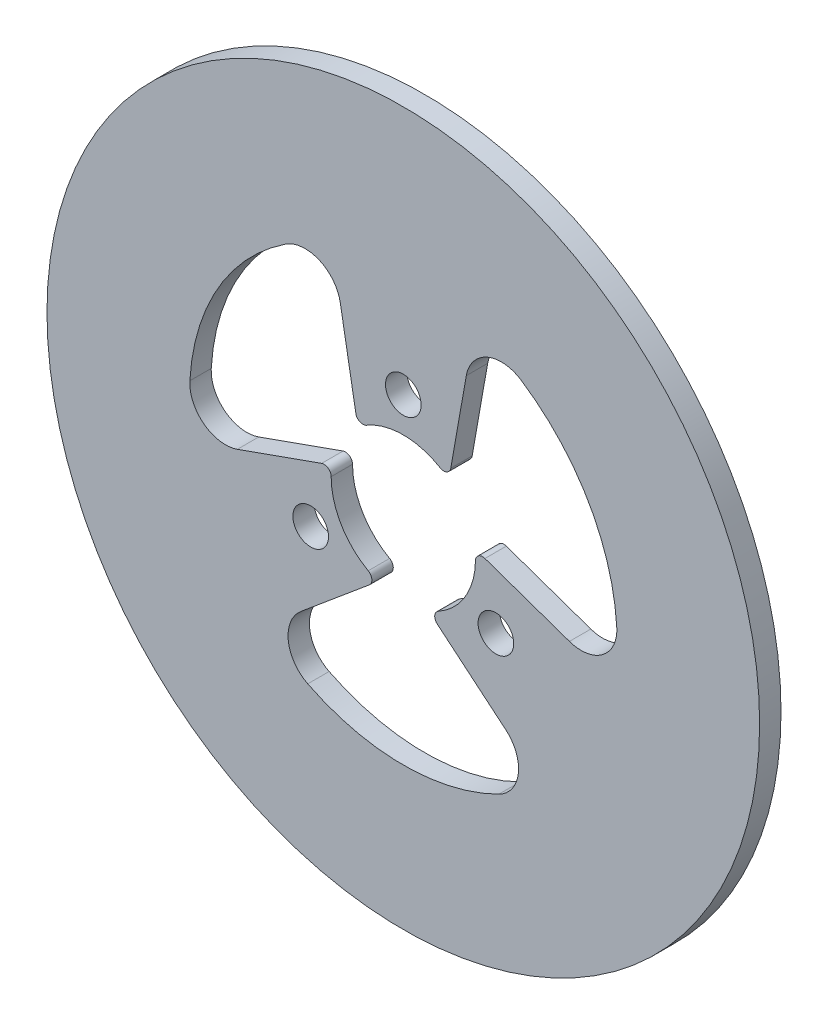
ISO-10303-21;
HEADER;
FILE_DESCRIPTION(('STEP AP214'),'2;1');
FILE_NAME('part.step','',(''),(''),'','','');
FILE_SCHEMA(('AUTOMOTIVE_DESIGN { 1 0 10303 214 1 1 1 1 }'));
ENDSEC;
DATA;
#1=APPLICATION_CONTEXT('core data for automotive mechanical design processes');
#2=APPLICATION_PROTOCOL_DEFINITION('international standard','automotive_design',2000,#1);
#3=PRODUCT_CONTEXT('',#1,'mechanical');
#4=PRODUCT('Part','Part','',(#3));
#5=PRODUCT_RELATED_PRODUCT_CATEGORY('part','',(#4));
#6=PRODUCT_DEFINITION_FORMATION('','',#4);
#7=PRODUCT_DEFINITION_CONTEXT('part definition',#1,'design');
#8=PRODUCT_DEFINITION('design','',#6,#7);
#9=PRODUCT_DEFINITION_SHAPE('','',#8);
#10=(LENGTH_UNIT() NAMED_UNIT(*) SI_UNIT(.MILLI.,.METRE.));
#11=(NAMED_UNIT(*) PLANE_ANGLE_UNIT() SI_UNIT($,.RADIAN.));
#12=(NAMED_UNIT(*) SI_UNIT($,.STERADIAN.) SOLID_ANGLE_UNIT());
#13=UNCERTAINTY_MEASURE_WITH_UNIT(LENGTH_MEASURE(1.E-05),#10,'distance_accuracy_value','');
#14=(GEOMETRIC_REPRESENTATION_CONTEXT(3) GLOBAL_UNCERTAINTY_ASSIGNED_CONTEXT((#13)) GLOBAL_UNIT_ASSIGNED_CONTEXT((#10,
#11,#12)) REPRESENTATION_CONTEXT('',''));
#15=CARTESIAN_POINT('',(0.,0.,0.));
#16=DIRECTION('',(0.,0.,1.));
#17=DIRECTION('',(1.,0.,0.));
#18=AXIS2_PLACEMENT_3D('',#15,#16,#17);
#19=CARTESIAN_POINT('',(0.,0.,6.));
#20=DIRECTION('',(0.,0.,1.));
#21=DIRECTION('',(1.,0.,0.));
#22=AXIS2_PLACEMENT_3D('',#19,#20,#21);
#23=PLANE('',#22);
#24=CARTESIAN_POINT('',(-25.9807621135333,-14.9999999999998,6.));
#25=DIRECTION('',(0.,0.,1.));
#26=DIRECTION('',(1.,0.,0.));
#27=AXIS2_PLACEMENT_3D('',#24,#25,#26);
#28=CIRCLE('',#27,5.);
#29=CARTESIAN_POINT('',(-20.9807621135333,-14.9999999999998,6.));
#30=VERTEX_POINT('',#29);
#31=EDGE_CURVE('E399',#30,#30,#28,.T.);
#32=ORIENTED_EDGE('',*,*,#31,.F.);
#33=EDGE_LOOP('',(#32));
#34=FACE_BOUND('',#33,.T.);
#35=DIRECTION('',(-0.942267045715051,-0.334862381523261,0.));
#36=VECTOR('',#35,1.);
#37=CARTESIAN_POINT('',(-22.9197049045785,1.85480697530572,6.));
#38=LINE('',#37,#36);
#39=CARTESIAN_POINT('',(-22.9197049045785,1.85480697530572,6.));
#40=VERTEX_POINT('',#39);
#41=CARTESIAN_POINT('',(-46.5687616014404,-6.5495827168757,6.));
#42=VERTEX_POINT('',#41);
#43=EDGE_CURVE('E285',#40,#42,#38,.T.);
#44=ORIENTED_EDGE('',*,*,#43,.T.);
#45=CARTESIAN_POINT('',(-49.917385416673,2.8730877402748,6.));
#46=DIRECTION('',(0.,0.,1.));
#47=DIRECTION('',(1.,0.,0.));
#48=AXIS2_PLACEMENT_3D('',#45,#46,#47);
#49=CIRCLE('',#48,9.99999999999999);
#50=CARTESIAN_POINT('',(-59.9008625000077,3.44770528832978,6.));
#51=VERTEX_POINT('',#50);
#52=EDGE_CURVE('E197',#51,#42,#49,.T.);
#53=ORIENTED_EDGE('',*,*,#52,.F.);
#54=CARTESIAN_POINT('',(0.,0.,6.));
#55=DIRECTION('',(0.,0.,1.));
#56=DIRECTION('',(1.,0.,0.));
#57=AXIS2_PLACEMENT_3D('',#54,#55,#56);
#58=CIRCLE('',#57,60.);
#59=CARTESIAN_POINT('',(-33.0299796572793,50.0901232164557,6.));
#60=VERTEX_POINT('',#59);
#61=EDGE_CURVE('E332',#60,#51,#58,.T.);
#62=ORIENTED_EDGE('',*,*,#61,.F.);
#63=CARTESIAN_POINT('',(-27.5249830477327,41.7417693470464,6.));
#64=DIRECTION('',(0.,0.,1.));
#65=DIRECTION('',(1.,0.,0.));
#66=AXIS2_PLACEMENT_3D('',#63,#64,#65);
#67=CIRCLE('',#66,10.);
#68=CARTESIAN_POINT('',(-17.6773131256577,43.4805611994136,6.));
#69=VERTEX_POINT('',#68);
#70=EDGE_CURVE('E330',#69,#60,#67,.T.);
#71=ORIENTED_EDGE('',*,*,#70,.F.);
#72=DIRECTION('',(-0.173879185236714,0.984766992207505,0.));
#73=VECTOR('',#72,1.);
#74=CARTESIAN_POINT('',(-13.3178423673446,18.790642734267,6.));
#75=LINE('',#74,#73);
#76=CARTESIAN_POINT('',(-13.3178423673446,18.790642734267,6.));
#77=VERTEX_POINT('',#76);
#78=EDGE_CURVE('E328',#77,#69,#75,.T.);
#79=ORIENTED_EDGE('',*,*,#78,.F.);
#80=CARTESIAN_POINT('',(-11.3483083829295,19.1384011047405,6.));
#81=DIRECTION('',(0.,0.,-1.));
#82=DIRECTION('',(-1.,0.,0.));
#83=AXIS2_PLACEMENT_3D('',#80,#81,#82);
#84=CIRCLE('',#83,2.);
#85=CARTESIAN_POINT('',(-10.3282357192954,17.4180953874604,6.));
#86=VERTEX_POINT('',#85);
#87=EDGE_CURVE('E326',#86,#77,#84,.T.);
#88=ORIENTED_EDGE('',*,*,#87,.F.);
#89=CARTESIAN_POINT('',(0.,0.,6.));
#90=DIRECTION('',(0.,0.,1.));
#91=DIRECTION('',(1.,0.,0.));
#92=AXIS2_PLACEMENT_3D('',#89,#90,#91);
#93=CIRCLE('',#92,20.25);
#94=CARTESIAN_POINT('',(10.3282357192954,17.4180953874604,6.));
#95=VERTEX_POINT('',#94);
#96=EDGE_CURVE('E324',#95,#86,#93,.T.);
#97=ORIENTED_EDGE('',*,*,#96,.F.);
#98=CARTESIAN_POINT('',(11.3483083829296,19.1384011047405,6.));
#99=DIRECTION('',(0.,0.,-1.));
#100=DIRECTION('',(-1.,0.,0.));
#101=AXIS2_PLACEMENT_3D('',#98,#99,#100);
#102=CIRCLE('',#101,2.);
#103=CARTESIAN_POINT('',(13.3178423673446,18.790642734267,6.));
#104=VERTEX_POINT('',#103);
#105=EDGE_CURVE('E322',#104,#95,#102,.T.);
#106=ORIENTED_EDGE('',*,*,#105,.F.);
#107=DIRECTION('',(0.173879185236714,0.984766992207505,0.));
#108=VECTOR('',#107,1.);
#109=CARTESIAN_POINT('',(13.3178423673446,18.790642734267,6.));
#110=LINE('',#109,#108);
#111=CARTESIAN_POINT('',(17.6773131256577,43.4805611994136,6.));
#112=VERTEX_POINT('',#111);
#113=EDGE_CURVE('E319',#104,#112,#110,.T.);
#114=ORIENTED_EDGE('',*,*,#113,.T.);
#115=CARTESIAN_POINT('',(27.5249830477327,41.7417693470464,6.));
#116=DIRECTION('',(0.,0.,1.));
#117=DIRECTION('',(1.,0.,0.));
#118=AXIS2_PLACEMENT_3D('',#115,#116,#117);
#119=CIRCLE('',#118,10.);
#120=CARTESIAN_POINT('',(33.0299796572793,50.0901232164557,6.));
#121=VERTEX_POINT('',#120);
#122=EDGE_CURVE('E317',#121,#112,#119,.T.);
#123=ORIENTED_EDGE('',*,*,#122,.F.);
#124=CARTESIAN_POINT('',(0.,0.,6.));
#125=DIRECTION('',(0.,0.,1.));
#126=DIRECTION('',(1.,0.,0.));
#127=AXIS2_PLACEMENT_3D('',#124,#125,#126);
#128=CIRCLE('',#127,60.);
#129=CARTESIAN_POINT('',(59.9056594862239,3.36332596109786,6.));
#130=VERTEX_POINT('',#129);
#131=EDGE_CURVE('E315',#130,#121,#128,.T.);
#132=ORIENTED_EDGE('',*,*,#131,.F.);
#133=CARTESIAN_POINT('',(49.9213829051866,2.80277163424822,6.));
#134=DIRECTION('',(0.,0.,1.));
#135=DIRECTION('',(1.,0.,0.));
#136=AXIS2_PLACEMENT_3D('',#133,#134,#135);
#137=CIRCLE('',#136,9.99999999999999);
#138=CARTESIAN_POINT('',(46.6193873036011,-6.63633982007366,6.));
#139=VERTEX_POINT('',#138);
#140=EDGE_CURVE('E313',#139,#130,#137,.T.);
#141=ORIENTED_EDGE('',*,*,#140,.F.);
#142=DIRECTION('',(0.943911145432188,-0.330199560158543,0.));
#143=VECTOR('',#142,1.);
#144=CARTESIAN_POINT('',(22.9092118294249,1.65796791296,6.));
#145=LINE('',#144,#143);
#146=CARTESIAN_POINT('',(22.9092118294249,1.65796791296,6.));
#147=VERTEX_POINT('',#146);
#148=EDGE_CURVE('E311',#147,#139,#145,.T.);
#149=ORIENTED_EDGE('',*,*,#148,.F.);
#150=CARTESIAN_POINT('',(22.2488127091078,-0.229854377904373,6.));
#151=DIRECTION('',(0.,0.,-1.));
#152=DIRECTION('',(-1.,0.,0.));
#153=AXIS2_PLACEMENT_3D('',#150,#151,#152);
#154=CIRCLE('',#153,2.);
#155=CARTESIAN_POINT('',(20.2489194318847,-0.209193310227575,6.));
#156=VERTEX_POINT('',#155);
#157=EDGE_CURVE('E309',#156,#147,#154,.T.);
#158=ORIENTED_EDGE('',*,*,#157,.F.);
#159=CARTESIAN_POINT('',(0.,0.,6.));
#160=DIRECTION('',(0.,0.,1.));
#161=DIRECTION('',(1.,0.,0.));
#162=AXIS2_PLACEMENT_3D('',#159,#160,#161);
#163=CIRCLE('',#162,20.25);
#164=CARTESIAN_POINT('',(9.8430576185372,-17.696799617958,6.));
#165=VERTEX_POINT('',#164);
#166=EDGE_CURVE('E307',#165,#156,#163,.T.);
#167=ORIENTED_EDGE('',*,*,#166,.F.);
#168=CARTESIAN_POINT('',(10.8152114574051,-19.4446316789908,6.));
#169=DIRECTION('',(0.,0.,-1.));
#170=DIRECTION('',(-1.,0.,0.));
#171=AXIS2_PLACEMENT_3D('',#168,#169,#170);
#172=CIRCLE('',#171,2.);
#173=CARTESIAN_POINT('',(9.53244896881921,-20.9790763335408,6.));
#174=VERTEX_POINT('',#173);
#175=EDGE_CURVE('E305',#174,#165,#172,.T.);
#176=ORIENTED_EDGE('',*,*,#175,.F.);
#177=DIRECTION('',(0.767222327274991,-0.64138124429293,0.));
#178=VECTOR('',#177,1.);
#179=CARTESIAN_POINT('',(9.53244896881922,-20.9790763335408,6.));
#180=LINE('',#179,#178);
#181=CARTESIAN_POINT('',(28.7626107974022,-37.0550750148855,6.));
#182=VERTEX_POINT('',#181);
#183=EDGE_CURVE('E302',#174,#182,#180,.T.);
#184=ORIENTED_EDGE('',*,*,#183,.T.);
#185=CARTESIAN_POINT('',(22.3487983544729,-44.7272982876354,6.));
#186=DIRECTION('',(0.,0.,1.));
#187=DIRECTION('',(1.,0.,0.));
#188=AXIS2_PLACEMENT_3D('',#185,#186,#187);
#189=CIRCLE('',#188,9.99999999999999);
#190=CARTESIAN_POINT('',(26.8185580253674,-53.6727579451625,6.));
#191=VERTEX_POINT('',#190);
#192=EDGE_CURVE('E300',#191,#182,#189,.T.);
#193=ORIENTED_EDGE('',*,*,#192,.F.);
#194=CARTESIAN_POINT('',(0.,0.,6.));
#195=DIRECTION('',(0.,0.,1.));
#196=DIRECTION('',(1.,0.,0.));
#197=AXIS2_PLACEMENT_3D('',#194,#195,#196);
#198=CIRCLE('',#197,60.);
#199=CARTESIAN_POINT('',(-26.8185580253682,-53.6727579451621,6.));
#200=VERTEX_POINT('',#199);
#201=EDGE_CURVE('E298',#200,#191,#198,.T.);
#202=ORIENTED_EDGE('',*,*,#201,.F.);
#203=CARTESIAN_POINT('',(-22.3487983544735,-44.7272982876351,6.));
#204=DIRECTION('',(0.,0.,1.));
#205=DIRECTION('',(1.,0.,0.));
#206=AXIS2_PLACEMENT_3D('',#203,#204,#205);
#207=CIRCLE('',#206,9.99999999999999);
#208=CARTESIAN_POINT('',(-28.7626107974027,-37.0550750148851,6.));
#209=VERTEX_POINT('',#208);
#210=EDGE_CURVE('E296',#209,#200,#207,.T.);
#211=ORIENTED_EDGE('',*,*,#210,.F.);
#212=DIRECTION('',(-0.767222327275,-0.641381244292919,0.));
#213=VECTOR('',#212,1.);
#214=CARTESIAN_POINT('',(-9.53244896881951,-20.9790763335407,6.));
#215=LINE('',#214,#213);
#216=CARTESIAN_POINT('',(-9.53244896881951,-20.9790763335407,6.));
#217=VERTEX_POINT('',#216);
#218=EDGE_CURVE('E294',#217,#209,#215,.T.);
#219=ORIENTED_EDGE('',*,*,#218,.F.);
#220=CARTESIAN_POINT('',(-10.8152114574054,-19.4446316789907,6.));
#221=DIRECTION('',(0.,0.,-1.));
#222=DIRECTION('',(-1.,0.,0.));
#223=AXIS2_PLACEMENT_3D('',#220,#221,#222);
#224=CIRCLE('',#223,2.);
#225=CARTESIAN_POINT('',(-9.84305761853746,-17.6967996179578,6.));
#226=VERTEX_POINT('',#225);
#227=EDGE_CURVE('E292',#226,#217,#224,.T.);
#228=ORIENTED_EDGE('',*,*,#227,.F.);
#229=CARTESIAN_POINT('',(0.,0.,6.));
#230=DIRECTION('',(0.,0.,1.));
#231=DIRECTION('',(1.,0.,0.));
#232=AXIS2_PLACEMENT_3D('',#229,#230,#231);
#233=CIRCLE('',#232,20.25);
#234=CARTESIAN_POINT('',(-20.2499819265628,-0.0270550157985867,6.));
#235=VERTEX_POINT('',#234);
#236=EDGE_CURVE('E290',#235,#226,#233,.T.);
#237=ORIENTED_EDGE('',*,*,#236,.F.);
#238=CARTESIAN_POINT('',(-22.249980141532,-0.0297271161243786,6.));
#239=DIRECTION('',(0.,0.,1.));
#240=DIRECTION('',(1.,0.,0.));
#241=AXIS2_PLACEMENT_3D('',#238,#239,#240);
#242=CIRCLE('',#241,2.);
#243=EDGE_CURVE('E287',#235,#40,#242,.T.);
#244=ORIENTED_EDGE('',*,*,#243,.T.);
#245=EDGE_LOOP('',(#44,#53,#62,#71,#79,#88,#97,#106,#114,#123,#132,#141,#149,#158,#167,#176,
#184,#193,#202,#211,#219,#228,#237,#244));
#246=FACE_BOUND('',#245,.T.);
#247=CARTESIAN_POINT('',(0.,0.,6.));
#248=DIRECTION('',(0.,0.,1.));
#249=DIRECTION('',(1.,0.,0.));
#250=AXIS2_PLACEMENT_3D('',#247,#248,#249);
#251=CIRCLE('',#250,100.);
#252=CARTESIAN_POINT('',(100.,0.,6.));
#253=VERTEX_POINT('',#252);
#254=EDGE_CURVE('E11',#253,#253,#251,.T.);
#255=ORIENTED_EDGE('',*,*,#254,.T.);
#256=EDGE_LOOP('',(#255));
#257=FACE_BOUND('',#256,.T.);
#258=CARTESIAN_POINT('',(0.,30.,6.));
#259=DIRECTION('',(0.,0.,1.));
#260=DIRECTION('',(1.,0.,0.));
#261=AXIS2_PLACEMENT_3D('',#258,#259,#260);
#262=CIRCLE('',#261,5.);
#263=CARTESIAN_POINT('',(5.,30.,6.));
#264=VERTEX_POINT('',#263);
#265=EDGE_CURVE('E216',#264,#264,#262,.T.);
#266=ORIENTED_EDGE('',*,*,#265,.F.);
#267=EDGE_LOOP('',(#266));
#268=FACE_BOUND('',#267,.T.);
#269=CARTESIAN_POINT('',(25.9807621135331,-15.0000000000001,6.));
#270=DIRECTION('',(0.,0.,1.));
#271=DIRECTION('',(1.,0.,0.));
#272=AXIS2_PLACEMENT_3D('',#269,#270,#271);
#273=CIRCLE('',#272,5.);
#274=CARTESIAN_POINT('',(30.9807621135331,-15.0000000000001,6.));
#275=VERTEX_POINT('',#274);
#276=EDGE_CURVE('E391',#275,#275,#273,.T.);
#277=ORIENTED_EDGE('',*,*,#276,.F.);
#278=EDGE_LOOP('',(#277));
#279=FACE_BOUND('',#278,.T.);
#280=ADVANCED_FACE('F33',(#34,#246,#257,#268,#279),#23,.T.);
#281=CARTESIAN_POINT('',(0.,0.,0.));
#282=DIRECTION('',(0.,0.,1.));
#283=DIRECTION('',(1.,0.,0.));
#284=AXIS2_PLACEMENT_3D('',#281,#282,#283);
#285=PLANE('',#284);
#286=CARTESIAN_POINT('',(-25.9807621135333,-14.9999999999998,0.));
#287=DIRECTION('',(0.,0.,1.));
#288=DIRECTION('',(1.,0.,0.));
#289=AXIS2_PLACEMENT_3D('',#286,#287,#288);
#290=CIRCLE('',#289,5.);
#291=CARTESIAN_POINT('',(-20.9807621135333,-14.9999999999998,0.));
#292=VERTEX_POINT('',#291);
#293=EDGE_CURVE('E394',#292,#292,#290,.T.);
#294=ORIENTED_EDGE('',*,*,#293,.T.);
#295=EDGE_LOOP('',(#294));
#296=FACE_BOUND('',#295,.T.);
#297=CARTESIAN_POINT('',(-49.917385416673,2.8730877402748,0.));
#298=DIRECTION('',(0.,0.,1.));
#299=DIRECTION('',(1.,0.,0.));
#300=AXIS2_PLACEMENT_3D('',#297,#298,#299);
#301=CIRCLE('',#300,9.99999999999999);
#302=CARTESIAN_POINT('',(-59.9008625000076,3.44770528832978,0.));
#303=VERTEX_POINT('',#302);
#304=CARTESIAN_POINT('',(-46.5687616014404,-6.5495827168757,0.));
#305=VERTEX_POINT('',#304);
#306=EDGE_CURVE('E56',#303,#305,#301,.T.);
#307=ORIENTED_EDGE('',*,*,#306,.T.);
#308=DIRECTION('',(-0.942267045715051,-0.334862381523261,0.));
#309=VECTOR('',#308,1.);
#310=CARTESIAN_POINT('',(-22.9197049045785,1.85480697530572,0.));
#311=LINE('',#310,#309);
#312=CARTESIAN_POINT('',(-22.9197049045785,1.85480697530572,0.));
#313=VERTEX_POINT('',#312);
#314=EDGE_CURVE('E204',#313,#305,#311,.T.);
#315=ORIENTED_EDGE('',*,*,#314,.F.);
#316=CARTESIAN_POINT('',(-22.249980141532,-0.0297271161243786,0.));
#317=DIRECTION('',(0.,0.,1.));
#318=DIRECTION('',(1.,0.,0.));
#319=AXIS2_PLACEMENT_3D('',#316,#317,#318);
#320=CIRCLE('',#319,2.);
#321=CARTESIAN_POINT('',(-20.2499819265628,-0.0270550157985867,0.));
#322=VERTEX_POINT('',#321);
#323=EDGE_CURVE('E209',#322,#313,#320,.T.);
#324=ORIENTED_EDGE('',*,*,#323,.F.);
#325=CARTESIAN_POINT('',(0.,0.,0.));
#326=DIRECTION('',(0.,0.,1.));
#327=DIRECTION('',(1.,0.,0.));
#328=AXIS2_PLACEMENT_3D('',#325,#326,#327);
#329=CIRCLE('',#328,20.25);
#330=CARTESIAN_POINT('',(-9.84305761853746,-17.6967996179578,0.));
#331=VERTEX_POINT('',#330);
#332=EDGE_CURVE('E224',#322,#331,#329,.T.);
#333=ORIENTED_EDGE('',*,*,#332,.T.);
#334=CARTESIAN_POINT('',(-10.8152114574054,-19.4446316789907,0.));
#335=DIRECTION('',(0.,0.,-1.));
#336=DIRECTION('',(-1.,0.,0.));
#337=AXIS2_PLACEMENT_3D('',#334,#335,#336);
#338=CIRCLE('',#337,2.);
#339=CARTESIAN_POINT('',(-9.53244896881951,-20.9790763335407,0.));
#340=VERTEX_POINT('',#339);
#341=EDGE_CURVE('E227',#331,#340,#338,.T.);
#342=ORIENTED_EDGE('',*,*,#341,.T.);
#343=DIRECTION('',(-0.767222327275,-0.641381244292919,0.));
#344=VECTOR('',#343,1.);
#345=CARTESIAN_POINT('',(-9.53244896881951,-20.9790763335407,0.));
#346=LINE('',#345,#344);
#347=CARTESIAN_POINT('',(-28.7626107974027,-37.0550750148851,0.));
#348=VERTEX_POINT('',#347);
#349=EDGE_CURVE('E230',#340,#348,#346,.T.);
#350=ORIENTED_EDGE('',*,*,#349,.T.);
#351=CARTESIAN_POINT('',(-22.3487983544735,-44.7272982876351,0.));
#352=DIRECTION('',(0.,0.,1.));
#353=DIRECTION('',(1.,0.,0.));
#354=AXIS2_PLACEMENT_3D('',#351,#352,#353);
#355=CIRCLE('',#354,9.99999999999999);
#356=CARTESIAN_POINT('',(-26.8185580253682,-53.6727579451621,0.));
#357=VERTEX_POINT('',#356);
#358=EDGE_CURVE('E233',#348,#357,#355,.T.);
#359=ORIENTED_EDGE('',*,*,#358,.T.);
#360=CARTESIAN_POINT('',(0.,0.,0.));
#361=DIRECTION('',(0.,0.,1.));
#362=DIRECTION('',(1.,0.,0.));
#363=AXIS2_PLACEMENT_3D('',#360,#361,#362);
#364=CIRCLE('',#363,60.);
#365=CARTESIAN_POINT('',(26.8185580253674,-53.6727579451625,0.));
#366=VERTEX_POINT('',#365);
#367=EDGE_CURVE('E236',#357,#366,#364,.T.);
#368=ORIENTED_EDGE('',*,*,#367,.T.);
#369=CARTESIAN_POINT('',(22.3487983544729,-44.7272982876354,0.));
#370=DIRECTION('',(0.,0.,1.));
#371=DIRECTION('',(1.,0.,0.));
#372=AXIS2_PLACEMENT_3D('',#369,#370,#371);
#373=CIRCLE('',#372,9.99999999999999);
#374=CARTESIAN_POINT('',(28.7626107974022,-37.0550750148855,0.));
#375=VERTEX_POINT('',#374);
#376=EDGE_CURVE('E239',#366,#375,#373,.T.);
#377=ORIENTED_EDGE('',*,*,#376,.T.);
#378=DIRECTION('',(0.767222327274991,-0.64138124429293,0.));
#379=VECTOR('',#378,1.);
#380=CARTESIAN_POINT('',(9.53244896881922,-20.9790763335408,0.));
#381=LINE('',#380,#379);
#382=CARTESIAN_POINT('',(9.53244896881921,-20.9790763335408,0.));
#383=VERTEX_POINT('',#382);
#384=EDGE_CURVE('E242',#383,#375,#381,.T.);
#385=ORIENTED_EDGE('',*,*,#384,.F.);
#386=CARTESIAN_POINT('',(10.8152114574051,-19.4446316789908,0.));
#387=DIRECTION('',(0.,0.,-1.));
#388=DIRECTION('',(-1.,0.,0.));
#389=AXIS2_PLACEMENT_3D('',#386,#387,#388);
#390=CIRCLE('',#389,2.);
#391=CARTESIAN_POINT('',(9.8430576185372,-17.696799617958,0.));
#392=VERTEX_POINT('',#391);
#393=EDGE_CURVE('E245',#383,#392,#390,.T.);
#394=ORIENTED_EDGE('',*,*,#393,.T.);
#395=CARTESIAN_POINT('',(0.,0.,0.));
#396=DIRECTION('',(0.,0.,1.));
#397=DIRECTION('',(1.,0.,0.));
#398=AXIS2_PLACEMENT_3D('',#395,#396,#397);
#399=CIRCLE('',#398,20.25);
#400=CARTESIAN_POINT('',(20.2489194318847,-0.209193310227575,0.));
#401=VERTEX_POINT('',#400);
#402=EDGE_CURVE('E248',#392,#401,#399,.T.);
#403=ORIENTED_EDGE('',*,*,#402,.T.);
#404=CARTESIAN_POINT('',(22.2488127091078,-0.229854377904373,0.));
#405=DIRECTION('',(0.,0.,-1.));
#406=DIRECTION('',(-1.,0.,0.));
#407=AXIS2_PLACEMENT_3D('',#404,#405,#406);
#408=CIRCLE('',#407,2.);
#409=CARTESIAN_POINT('',(22.9092118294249,1.65796791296,0.));
#410=VERTEX_POINT('',#409);
#411=EDGE_CURVE('E251',#401,#410,#408,.T.);
#412=ORIENTED_EDGE('',*,*,#411,.T.);
#413=DIRECTION('',(0.943911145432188,-0.330199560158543,0.));
#414=VECTOR('',#413,1.);
#415=CARTESIAN_POINT('',(22.9092118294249,1.65796791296,0.));
#416=LINE('',#415,#414);
#417=CARTESIAN_POINT('',(46.6193873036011,-6.63633982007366,0.));
#418=VERTEX_POINT('',#417);
#419=EDGE_CURVE('E254',#410,#418,#416,.T.);
#420=ORIENTED_EDGE('',*,*,#419,.T.);
#421=CARTESIAN_POINT('',(49.9213829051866,2.80277163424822,0.));
#422=DIRECTION('',(0.,0.,1.));
#423=DIRECTION('',(1.,0.,0.));
#424=AXIS2_PLACEMENT_3D('',#421,#422,#423);
#425=CIRCLE('',#424,9.99999999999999);
#426=CARTESIAN_POINT('',(59.9056594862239,3.36332596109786,0.));
#427=VERTEX_POINT('',#426);
#428=EDGE_CURVE('E257',#418,#427,#425,.T.);
#429=ORIENTED_EDGE('',*,*,#428,.T.);
#430=CARTESIAN_POINT('',(0.,0.,0.));
#431=DIRECTION('',(0.,0.,1.));
#432=DIRECTION('',(1.,0.,0.));
#433=AXIS2_PLACEMENT_3D('',#430,#431,#432);
#434=CIRCLE('',#433,60.);
#435=CARTESIAN_POINT('',(33.0299796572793,50.0901232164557,0.));
#436=VERTEX_POINT('',#435);
#437=EDGE_CURVE('E260',#427,#436,#434,.T.);
#438=ORIENTED_EDGE('',*,*,#437,.T.);
#439=CARTESIAN_POINT('',(27.5249830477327,41.7417693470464,0.));
#440=DIRECTION('',(0.,0.,1.));
#441=DIRECTION('',(1.,0.,0.));
#442=AXIS2_PLACEMENT_3D('',#439,#440,#441);
#443=CIRCLE('',#442,10.);
#444=CARTESIAN_POINT('',(17.6773131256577,43.4805611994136,0.));
#445=VERTEX_POINT('',#444);
#446=EDGE_CURVE('E263',#436,#445,#443,.T.);
#447=ORIENTED_EDGE('',*,*,#446,.T.);
#448=DIRECTION('',(0.173879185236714,0.984766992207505,0.));
#449=VECTOR('',#448,1.);
#450=CARTESIAN_POINT('',(13.3178423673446,18.790642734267,0.));
#451=LINE('',#450,#449);
#452=CARTESIAN_POINT('',(13.3178423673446,18.790642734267,0.));
#453=VERTEX_POINT('',#452);
#454=EDGE_CURVE('E266',#453,#445,#451,.T.);
#455=ORIENTED_EDGE('',*,*,#454,.F.);
#456=CARTESIAN_POINT('',(11.3483083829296,19.1384011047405,0.));
#457=DIRECTION('',(0.,0.,-1.));
#458=DIRECTION('',(-1.,0.,0.));
#459=AXIS2_PLACEMENT_3D('',#456,#457,#458);
#460=CIRCLE('',#459,2.);
#461=CARTESIAN_POINT('',(10.3282357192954,17.4180953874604,0.));
#462=VERTEX_POINT('',#461);
#463=EDGE_CURVE('E269',#453,#462,#460,.T.);
#464=ORIENTED_EDGE('',*,*,#463,.T.);
#465=CARTESIAN_POINT('',(0.,0.,0.));
#466=DIRECTION('',(0.,0.,1.));
#467=DIRECTION('',(1.,0.,0.));
#468=AXIS2_PLACEMENT_3D('',#465,#466,#467);
#469=CIRCLE('',#468,20.25);
#470=CARTESIAN_POINT('',(-10.3282357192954,17.4180953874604,0.));
#471=VERTEX_POINT('',#470);
#472=EDGE_CURVE('E272',#462,#471,#469,.T.);
#473=ORIENTED_EDGE('',*,*,#472,.T.);
#474=CARTESIAN_POINT('',(-11.3483083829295,19.1384011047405,0.));
#475=DIRECTION('',(0.,0.,-1.));
#476=DIRECTION('',(-1.,0.,0.));
#477=AXIS2_PLACEMENT_3D('',#474,#475,#476);
#478=CIRCLE('',#477,2.);
#479=CARTESIAN_POINT('',(-13.3178423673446,18.790642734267,0.));
#480=VERTEX_POINT('',#479);
#481=EDGE_CURVE('E275',#471,#480,#478,.T.);
#482=ORIENTED_EDGE('',*,*,#481,.T.);
#483=DIRECTION('',(-0.173879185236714,0.984766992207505,0.));
#484=VECTOR('',#483,1.);
#485=CARTESIAN_POINT('',(-13.3178423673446,18.790642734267,0.));
#486=LINE('',#485,#484);
#487=CARTESIAN_POINT('',(-17.6773131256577,43.4805611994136,0.));
#488=VERTEX_POINT('',#487);
#489=EDGE_CURVE('E278',#480,#488,#486,.T.);
#490=ORIENTED_EDGE('',*,*,#489,.T.);
#491=CARTESIAN_POINT('',(-27.5249830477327,41.7417693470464,0.));
#492=DIRECTION('',(0.,0.,1.));
#493=DIRECTION('',(1.,0.,0.));
#494=AXIS2_PLACEMENT_3D('',#491,#492,#493);
#495=CIRCLE('',#494,10.);
#496=CARTESIAN_POINT('',(-33.0299796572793,50.0901232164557,0.));
#497=VERTEX_POINT('',#496);
#498=EDGE_CURVE('E281',#488,#497,#495,.T.);
#499=ORIENTED_EDGE('',*,*,#498,.T.);
#500=CARTESIAN_POINT('',(0.,0.,0.));
#501=DIRECTION('',(0.,0.,1.));
#502=DIRECTION('',(1.,0.,0.));
#503=AXIS2_PLACEMENT_3D('',#500,#501,#502);
#504=CIRCLE('',#503,60.);
#505=EDGE_CURVE('E215',#497,#303,#504,.T.);
#506=ORIENTED_EDGE('',*,*,#505,.T.);
#507=EDGE_LOOP('',(#307,#315,#324,#333,#342,#350,#359,#368,#377,#385,#394,#403,#412,#420,#429,
#438,#447,#455,#464,#473,#482,#490,#499,#506));
#508=FACE_BOUND('',#507,.T.);
#509=CARTESIAN_POINT('',(0.,0.,0.));
#510=DIRECTION('',(0.,0.,1.));
#511=DIRECTION('',(1.,0.,0.));
#512=AXIS2_PLACEMENT_3D('',#509,#510,#511);
#513=CIRCLE('',#512,100.);
#514=CARTESIAN_POINT('',(100.,0.,0.));
#515=VERTEX_POINT('',#514);
#516=EDGE_CURVE('E41',#515,#515,#513,.T.);
#517=ORIENTED_EDGE('',*,*,#516,.F.);
#518=EDGE_LOOP('',(#517));
#519=FACE_BOUND('',#518,.T.);
#520=CARTESIAN_POINT('',(0.,30.,0.));
#521=DIRECTION('',(0.,0.,1.));
#522=DIRECTION('',(1.,0.,0.));
#523=AXIS2_PLACEMENT_3D('',#520,#521,#522);
#524=CIRCLE('',#523,5.);
#525=CARTESIAN_POINT('',(5.,30.,0.));
#526=VERTEX_POINT('',#525);
#527=EDGE_CURVE('E219',#526,#526,#524,.T.);
#528=ORIENTED_EDGE('',*,*,#527,.T.);
#529=EDGE_LOOP('',(#528));
#530=FACE_BOUND('',#529,.T.);
#531=CARTESIAN_POINT('',(25.9807621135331,-15.0000000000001,0.));
#532=DIRECTION('',(0.,0.,1.));
#533=DIRECTION('',(1.,0.,0.));
#534=AXIS2_PLACEMENT_3D('',#531,#532,#533);
#535=CIRCLE('',#534,5.);
#536=CARTESIAN_POINT('',(30.9807621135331,-15.0000000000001,0.));
#537=VERTEX_POINT('',#536);
#538=EDGE_CURVE('E389',#537,#537,#535,.T.);
#539=ORIENTED_EDGE('',*,*,#538,.T.);
#540=EDGE_LOOP('',(#539));
#541=FACE_BOUND('',#540,.T.);
#542=ADVANCED_FACE('F212',(#296,#508,#519,#530,#541),#285,.F.);
#543=CARTESIAN_POINT('',(0.,0.,6.));
#544=DIRECTION('',(0.,0.,-1.));
#545=DIRECTION('',(-1.,0.,0.));
#546=AXIS2_PLACEMENT_3D('',#543,#544,#545);
#547=CYLINDRICAL_SURFACE('',#546,100.);
#548=ORIENTED_EDGE('',*,*,#254,.F.);
#549=EDGE_LOOP('',(#548));
#550=FACE_BOUND('',#549,.T.);
#551=ORIENTED_EDGE('',*,*,#516,.T.);
#552=EDGE_LOOP('',(#551));
#553=FACE_BOUND('',#552,.T.);
#554=ADVANCED_FACE('F35',(#550,#553),#547,.T.);
#555=CARTESIAN_POINT('',(-49.917385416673,2.8730877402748,6.));
#556=DIRECTION('',(0.,0.,-1.));
#557=DIRECTION('',(-1.,0.,0.));
#558=AXIS2_PLACEMENT_3D('',#555,#556,#557);
#559=CYLINDRICAL_SURFACE('',#558,9.99999999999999);
#560=ORIENTED_EDGE('',*,*,#306,.F.);
#561=DIRECTION('',(0.,0.,-1.));
#562=VECTOR('',#561,1.);
#563=CARTESIAN_POINT('',(-59.9008625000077,3.44770528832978,6.));
#564=LINE('',#563,#562);
#565=EDGE_CURVE('E334',#51,#303,#564,.T.);
#566=ORIENTED_EDGE('',*,*,#565,.F.);
#567=ORIENTED_EDGE('',*,*,#52,.T.);
#568=DIRECTION('',(0.,0.,-1.));
#569=VECTOR('',#568,1.);
#570=CARTESIAN_POINT('',(-46.5687616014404,-6.5495827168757,6.));
#571=LINE('',#570,#569);
#572=EDGE_CURVE('E193',#42,#305,#571,.T.);
#573=ORIENTED_EDGE('',*,*,#572,.T.);
#574=EDGE_LOOP('',(#560,#566,#567,#573));
#575=FACE_BOUND('',#574,.T.);
#576=ADVANCED_FACE('F195',(#575),#559,.F.);
#577=CARTESIAN_POINT('',(-22.9197049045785,1.85480697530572,6.));
#578=DIRECTION('',(0.334862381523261,-0.942267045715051,0.));
#579=DIRECTION('',(0.942267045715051,0.334862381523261,0.));
#580=AXIS2_PLACEMENT_3D('',#577,#578,#579);
#581=PLANE('',#580);
#582=ORIENTED_EDGE('',*,*,#314,.T.);
#583=ORIENTED_EDGE('',*,*,#572,.F.);
#584=ORIENTED_EDGE('',*,*,#43,.F.);
#585=DIRECTION('',(0.,0.,-1.));
#586=VECTOR('',#585,1.);
#587=CARTESIAN_POINT('',(-22.9197049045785,1.85480697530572,6.));
#588=LINE('',#587,#586);
#589=EDGE_CURVE('E201',#40,#313,#588,.T.);
#590=ORIENTED_EDGE('',*,*,#589,.T.);
#591=EDGE_LOOP('',(#582,#583,#584,#590));
#592=FACE_BOUND('',#591,.T.);
#593=ADVANCED_FACE('F205',(#592),#581,.F.);
#594=CARTESIAN_POINT('',(-22.249980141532,-0.0297271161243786,6.));
#595=DIRECTION('',(0.,0.,-1.));
#596=DIRECTION('',(-1.,0.,0.));
#597=AXIS2_PLACEMENT_3D('',#594,#595,#596);
#598=CYLINDRICAL_SURFACE('',#597,2.);
#599=ORIENTED_EDGE('',*,*,#323,.T.);
#600=ORIENTED_EDGE('',*,*,#589,.F.);
#601=ORIENTED_EDGE('',*,*,#243,.F.);
#602=DIRECTION('',(0.,0.,-1.));
#603=VECTOR('',#602,1.);
#604=CARTESIAN_POINT('',(-20.2499819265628,-0.0270550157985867,6.));
#605=LINE('',#604,#603);
#606=EDGE_CURVE('E375',#235,#322,#605,.T.);
#607=ORIENTED_EDGE('',*,*,#606,.T.);
#608=EDGE_LOOP('',(#599,#600,#601,#607));
#609=FACE_BOUND('',#608,.T.);
#610=ADVANCED_FACE('F509',(#609),#598,.T.);
#611=CARTESIAN_POINT('',(0.,0.,6.));
#612=DIRECTION('',(0.,0.,-1.));
#613=DIRECTION('',(-1.,0.,0.));
#614=AXIS2_PLACEMENT_3D('',#611,#612,#613);
#615=CYLINDRICAL_SURFACE('',#614,20.25);
#616=ORIENTED_EDGE('',*,*,#332,.F.);
#617=ORIENTED_EDGE('',*,*,#606,.F.);
#618=ORIENTED_EDGE('',*,*,#236,.T.);
#619=DIRECTION('',(0.,0.,-1.));
#620=VECTOR('',#619,1.);
#621=CARTESIAN_POINT('',(-9.84305761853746,-17.6967996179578,6.));
#622=LINE('',#621,#620);
#623=EDGE_CURVE('E373',#226,#331,#622,.T.);
#624=ORIENTED_EDGE('',*,*,#623,.T.);
#625=EDGE_LOOP('',(#616,#617,#618,#624));
#626=FACE_BOUND('',#625,.T.);
#627=ADVANCED_FACE('F505',(#626),#615,.F.);
#628=CARTESIAN_POINT('',(-10.8152114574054,-19.4446316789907,6.));
#629=DIRECTION('',(0.,0.,-1.));
#630=DIRECTION('',(-1.,0.,0.));
#631=AXIS2_PLACEMENT_3D('',#628,#629,#630);
#632=CYLINDRICAL_SURFACE('',#631,2.);
#633=ORIENTED_EDGE('',*,*,#341,.F.);
#634=ORIENTED_EDGE('',*,*,#623,.F.);
#635=ORIENTED_EDGE('',*,*,#227,.T.);
#636=DIRECTION('',(0.,0.,-1.));
#637=VECTOR('',#636,1.);
#638=CARTESIAN_POINT('',(-9.53244896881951,-20.9790763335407,6.));
#639=LINE('',#638,#637);
#640=EDGE_CURVE('E371',#217,#340,#639,.T.);
#641=ORIENTED_EDGE('',*,*,#640,.T.);
#642=EDGE_LOOP('',(#633,#634,#635,#641));
#643=FACE_BOUND('',#642,.T.);
#644=ADVANCED_FACE('F501',(#643),#632,.T.);
#645=CARTESIAN_POINT('',(-9.53244896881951,-20.9790763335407,6.));
#646=DIRECTION('',(0.641381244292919,-0.767222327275,0.));
#647=DIRECTION('',(0.767222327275,0.641381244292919,0.));
#648=AXIS2_PLACEMENT_3D('',#645,#646,#647);
#649=PLANE('',#648);
#650=ORIENTED_EDGE('',*,*,#349,.F.);
#651=ORIENTED_EDGE('',*,*,#640,.F.);
#652=ORIENTED_EDGE('',*,*,#218,.T.);
#653=DIRECTION('',(0.,0.,-1.));
#654=VECTOR('',#653,1.);
#655=CARTESIAN_POINT('',(-28.7626107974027,-37.0550750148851,6.));
#656=LINE('',#655,#654);
#657=EDGE_CURVE('E369',#209,#348,#656,.T.);
#658=ORIENTED_EDGE('',*,*,#657,.T.);
#659=EDGE_LOOP('',(#650,#651,#652,#658));
#660=FACE_BOUND('',#659,.T.);
#661=ADVANCED_FACE('F497',(#660),#649,.T.);
#662=CARTESIAN_POINT('',(-22.3487983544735,-44.7272982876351,6.));
#663=DIRECTION('',(0.,0.,-1.));
#664=DIRECTION('',(-1.,0.,0.));
#665=AXIS2_PLACEMENT_3D('',#662,#663,#664);
#666=CYLINDRICAL_SURFACE('',#665,9.99999999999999);
#667=ORIENTED_EDGE('',*,*,#358,.F.);
#668=ORIENTED_EDGE('',*,*,#657,.F.);
#669=ORIENTED_EDGE('',*,*,#210,.T.);
#670=DIRECTION('',(0.,0.,-1.));
#671=VECTOR('',#670,1.);
#672=CARTESIAN_POINT('',(-26.8185580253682,-53.6727579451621,6.));
#673=LINE('',#672,#671);
#674=EDGE_CURVE('E367',#200,#357,#673,.T.);
#675=ORIENTED_EDGE('',*,*,#674,.T.);
#676=EDGE_LOOP('',(#667,#668,#669,#675));
#677=FACE_BOUND('',#676,.T.);
#678=ADVANCED_FACE('F493',(#677),#666,.F.);
#679=CARTESIAN_POINT('',(0.,0.,6.));
#680=DIRECTION('',(0.,0.,-1.));
#681=DIRECTION('',(-1.,0.,0.));
#682=AXIS2_PLACEMENT_3D('',#679,#680,#681);
#683=CYLINDRICAL_SURFACE('',#682,60.);
#684=ORIENTED_EDGE('',*,*,#367,.F.);
#685=ORIENTED_EDGE('',*,*,#674,.F.);
#686=ORIENTED_EDGE('',*,*,#201,.T.);
#687=DIRECTION('',(0.,0.,-1.));
#688=VECTOR('',#687,1.);
#689=CARTESIAN_POINT('',(26.8185580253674,-53.6727579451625,6.));
#690=LINE('',#689,#688);
#691=EDGE_CURVE('E365',#191,#366,#690,.T.);
#692=ORIENTED_EDGE('',*,*,#691,.T.);
#693=EDGE_LOOP('',(#684,#685,#686,#692));
#694=FACE_BOUND('',#693,.T.);
#695=ADVANCED_FACE('F489',(#694),#683,.F.);
#696=CARTESIAN_POINT('',(22.3487983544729,-44.7272982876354,6.));
#697=DIRECTION('',(0.,0.,-1.));
#698=DIRECTION('',(-1.,0.,0.));
#699=AXIS2_PLACEMENT_3D('',#696,#697,#698);
#700=CYLINDRICAL_SURFACE('',#699,9.99999999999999);
#701=ORIENTED_EDGE('',*,*,#376,.F.);
#702=ORIENTED_EDGE('',*,*,#691,.F.);
#703=ORIENTED_EDGE('',*,*,#192,.T.);
#704=DIRECTION('',(0.,0.,-1.));
#705=VECTOR('',#704,1.);
#706=CARTESIAN_POINT('',(28.7626107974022,-37.0550750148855,6.));
#707=LINE('',#706,#705);
#708=EDGE_CURVE('E363',#182,#375,#707,.T.);
#709=ORIENTED_EDGE('',*,*,#708,.T.);
#710=EDGE_LOOP('',(#701,#702,#703,#709));
#711=FACE_BOUND('',#710,.T.);
#712=ADVANCED_FACE('F485',(#711),#700,.F.);
#713=CARTESIAN_POINT('',(9.53244896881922,-20.9790763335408,6.));
#714=DIRECTION('',(0.64138124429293,0.767222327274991,0.));
#715=DIRECTION('',(-0.767222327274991,0.64138124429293,0.));
#716=AXIS2_PLACEMENT_3D('',#713,#714,#715);
#717=PLANE('',#716);
#718=ORIENTED_EDGE('',*,*,#384,.T.);
#719=ORIENTED_EDGE('',*,*,#708,.F.);
#720=ORIENTED_EDGE('',*,*,#183,.F.);
#721=DIRECTION('',(0.,0.,-1.));
#722=VECTOR('',#721,1.);
#723=CARTESIAN_POINT('',(9.53244896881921,-20.9790763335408,6.));
#724=LINE('',#723,#722);
#725=EDGE_CURVE('E361',#174,#383,#724,.T.);
#726=ORIENTED_EDGE('',*,*,#725,.T.);
#727=EDGE_LOOP('',(#718,#719,#720,#726));
#728=FACE_BOUND('',#727,.T.);
#729=ADVANCED_FACE('F481',(#728),#717,.F.);
#730=CARTESIAN_POINT('',(10.8152114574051,-19.4446316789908,6.));
#731=DIRECTION('',(0.,0.,-1.));
#732=DIRECTION('',(-1.,0.,0.));
#733=AXIS2_PLACEMENT_3D('',#730,#731,#732);
#734=CYLINDRICAL_SURFACE('',#733,2.);
#735=ORIENTED_EDGE('',*,*,#393,.F.);
#736=ORIENTED_EDGE('',*,*,#725,.F.);
#737=ORIENTED_EDGE('',*,*,#175,.T.);
#738=DIRECTION('',(0.,0.,-1.));
#739=VECTOR('',#738,1.);
#740=CARTESIAN_POINT('',(9.8430576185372,-17.696799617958,6.));
#741=LINE('',#740,#739);
#742=EDGE_CURVE('E359',#165,#392,#741,.T.);
#743=ORIENTED_EDGE('',*,*,#742,.T.);
#744=EDGE_LOOP('',(#735,#736,#737,#743));
#745=FACE_BOUND('',#744,.T.);
#746=ADVANCED_FACE('F477',(#745),#734,.T.);
#747=CARTESIAN_POINT('',(0.,0.,6.));
#748=DIRECTION('',(0.,0.,-1.));
#749=DIRECTION('',(-1.,0.,0.));
#750=AXIS2_PLACEMENT_3D('',#747,#748,#749);
#751=CYLINDRICAL_SURFACE('',#750,20.25);
#752=ORIENTED_EDGE('',*,*,#402,.F.);
#753=ORIENTED_EDGE('',*,*,#742,.F.);
#754=ORIENTED_EDGE('',*,*,#166,.T.);
#755=DIRECTION('',(0.,0.,-1.));
#756=VECTOR('',#755,1.);
#757=CARTESIAN_POINT('',(20.2489194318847,-0.209193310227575,6.));
#758=LINE('',#757,#756);
#759=EDGE_CURVE('E357',#156,#401,#758,.T.);
#760=ORIENTED_EDGE('',*,*,#759,.T.);
#761=EDGE_LOOP('',(#752,#753,#754,#760));
#762=FACE_BOUND('',#761,.T.);
#763=ADVANCED_FACE('F473',(#762),#751,.F.);
#764=CARTESIAN_POINT('',(22.2488127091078,-0.229854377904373,6.));
#765=DIRECTION('',(0.,0.,-1.));
#766=DIRECTION('',(-1.,0.,0.));
#767=AXIS2_PLACEMENT_3D('',#764,#765,#766);
#768=CYLINDRICAL_SURFACE('',#767,2.);
#769=ORIENTED_EDGE('',*,*,#411,.F.);
#770=ORIENTED_EDGE('',*,*,#759,.F.);
#771=ORIENTED_EDGE('',*,*,#157,.T.);
#772=DIRECTION('',(0.,0.,-1.));
#773=VECTOR('',#772,1.);
#774=CARTESIAN_POINT('',(22.9092118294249,1.65796791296,6.));
#775=LINE('',#774,#773);
#776=EDGE_CURVE('E355',#147,#410,#775,.T.);
#777=ORIENTED_EDGE('',*,*,#776,.T.);
#778=EDGE_LOOP('',(#769,#770,#771,#777));
#779=FACE_BOUND('',#778,.T.);
#780=ADVANCED_FACE('F469',(#779),#768,.T.);
#781=CARTESIAN_POINT('',(22.9092118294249,1.65796791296,6.));
#782=DIRECTION('',(0.330199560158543,0.943911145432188,0.));
#783=DIRECTION('',(-0.943911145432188,0.330199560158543,0.));
#784=AXIS2_PLACEMENT_3D('',#781,#782,#783);
#785=PLANE('',#784);
#786=ORIENTED_EDGE('',*,*,#419,.F.);
#787=ORIENTED_EDGE('',*,*,#776,.F.);
#788=ORIENTED_EDGE('',*,*,#148,.T.);
#789=DIRECTION('',(0.,0.,-1.));
#790=VECTOR('',#789,1.);
#791=CARTESIAN_POINT('',(46.6193873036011,-6.63633982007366,6.));
#792=LINE('',#791,#790);
#793=EDGE_CURVE('E353',#139,#418,#792,.T.);
#794=ORIENTED_EDGE('',*,*,#793,.T.);
#795=EDGE_LOOP('',(#786,#787,#788,#794));
#796=FACE_BOUND('',#795,.T.);
#797=ADVANCED_FACE('F465',(#796),#785,.T.);
#798=CARTESIAN_POINT('',(49.9213829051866,2.80277163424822,6.));
#799=DIRECTION('',(0.,0.,-1.));
#800=DIRECTION('',(-1.,0.,0.));
#801=AXIS2_PLACEMENT_3D('',#798,#799,#800);
#802=CYLINDRICAL_SURFACE('',#801,9.99999999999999);
#803=ORIENTED_EDGE('',*,*,#428,.F.);
#804=ORIENTED_EDGE('',*,*,#793,.F.);
#805=ORIENTED_EDGE('',*,*,#140,.T.);
#806=DIRECTION('',(0.,0.,-1.));
#807=VECTOR('',#806,1.);
#808=CARTESIAN_POINT('',(59.9056594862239,3.36332596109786,6.));
#809=LINE('',#808,#807);
#810=EDGE_CURVE('E351',#130,#427,#809,.T.);
#811=ORIENTED_EDGE('',*,*,#810,.T.);
#812=EDGE_LOOP('',(#803,#804,#805,#811));
#813=FACE_BOUND('',#812,.T.);
#814=ADVANCED_FACE('F461',(#813),#802,.F.);
#815=CARTESIAN_POINT('',(0.,0.,6.));
#816=DIRECTION('',(0.,0.,-1.));
#817=DIRECTION('',(-1.,0.,0.));
#818=AXIS2_PLACEMENT_3D('',#815,#816,#817);
#819=CYLINDRICAL_SURFACE('',#818,60.);
#820=ORIENTED_EDGE('',*,*,#437,.F.);
#821=ORIENTED_EDGE('',*,*,#810,.F.);
#822=ORIENTED_EDGE('',*,*,#131,.T.);
#823=DIRECTION('',(0.,0.,-1.));
#824=VECTOR('',#823,1.);
#825=CARTESIAN_POINT('',(33.0299796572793,50.0901232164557,6.));
#826=LINE('',#825,#824);
#827=EDGE_CURVE('E349',#121,#436,#826,.T.);
#828=ORIENTED_EDGE('',*,*,#827,.T.);
#829=EDGE_LOOP('',(#820,#821,#822,#828));
#830=FACE_BOUND('',#829,.T.);
#831=ADVANCED_FACE('F457',(#830),#819,.F.);
#832=CARTESIAN_POINT('',(27.5249830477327,41.7417693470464,6.));
#833=DIRECTION('',(0.,0.,-1.));
#834=DIRECTION('',(-1.,0.,0.));
#835=AXIS2_PLACEMENT_3D('',#832,#833,#834);
#836=CYLINDRICAL_SURFACE('',#835,10.);
#837=ORIENTED_EDGE('',*,*,#446,.F.);
#838=ORIENTED_EDGE('',*,*,#827,.F.);
#839=ORIENTED_EDGE('',*,*,#122,.T.);
#840=DIRECTION('',(0.,0.,-1.));
#841=VECTOR('',#840,1.);
#842=CARTESIAN_POINT('',(17.6773131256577,43.4805611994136,6.));
#843=LINE('',#842,#841);
#844=EDGE_CURVE('E347',#112,#445,#843,.T.);
#845=ORIENTED_EDGE('',*,*,#844,.T.);
#846=EDGE_LOOP('',(#837,#838,#839,#845));
#847=FACE_BOUND('',#846,.T.);
#848=ADVANCED_FACE('F453',(#847),#836,.F.);
#849=CARTESIAN_POINT('',(13.3178423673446,18.790642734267,6.));
#850=DIRECTION('',(-0.984766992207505,0.173879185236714,0.));
#851=DIRECTION('',(-0.173879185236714,-0.984766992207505,0.));
#852=AXIS2_PLACEMENT_3D('',#849,#850,#851);
#853=PLANE('',#852);
#854=ORIENTED_EDGE('',*,*,#454,.T.);
#855=ORIENTED_EDGE('',*,*,#844,.F.);
#856=ORIENTED_EDGE('',*,*,#113,.F.);
#857=DIRECTION('',(0.,0.,-1.));
#858=VECTOR('',#857,1.);
#859=CARTESIAN_POINT('',(13.3178423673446,18.790642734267,6.));
#860=LINE('',#859,#858);
#861=EDGE_CURVE('E345',#104,#453,#860,.T.);
#862=ORIENTED_EDGE('',*,*,#861,.T.);
#863=EDGE_LOOP('',(#854,#855,#856,#862));
#864=FACE_BOUND('',#863,.T.);
#865=ADVANCED_FACE('F449',(#864),#853,.F.);
#866=CARTESIAN_POINT('',(11.3483083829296,19.1384011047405,6.));
#867=DIRECTION('',(0.,0.,-1.));
#868=DIRECTION('',(-1.,0.,0.));
#869=AXIS2_PLACEMENT_3D('',#866,#867,#868);
#870=CYLINDRICAL_SURFACE('',#869,2.);
#871=ORIENTED_EDGE('',*,*,#463,.F.);
#872=ORIENTED_EDGE('',*,*,#861,.F.);
#873=ORIENTED_EDGE('',*,*,#105,.T.);
#874=DIRECTION('',(0.,0.,-1.));
#875=VECTOR('',#874,1.);
#876=CARTESIAN_POINT('',(10.3282357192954,17.4180953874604,6.));
#877=LINE('',#876,#875);
#878=EDGE_CURVE('E343',#95,#462,#877,.T.);
#879=ORIENTED_EDGE('',*,*,#878,.T.);
#880=EDGE_LOOP('',(#871,#872,#873,#879));
#881=FACE_BOUND('',#880,.T.);
#882=ADVANCED_FACE('F445',(#881),#870,.T.);
#883=CARTESIAN_POINT('',(0.,0.,6.));
#884=DIRECTION('',(0.,0.,-1.));
#885=DIRECTION('',(-1.,0.,0.));
#886=AXIS2_PLACEMENT_3D('',#883,#884,#885);
#887=CYLINDRICAL_SURFACE('',#886,20.25);
#888=ORIENTED_EDGE('',*,*,#472,.F.);
#889=ORIENTED_EDGE('',*,*,#878,.F.);
#890=ORIENTED_EDGE('',*,*,#96,.T.);
#891=DIRECTION('',(0.,0.,-1.));
#892=VECTOR('',#891,1.);
#893=CARTESIAN_POINT('',(-10.3282357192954,17.4180953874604,6.));
#894=LINE('',#893,#892);
#895=EDGE_CURVE('E341',#86,#471,#894,.T.);
#896=ORIENTED_EDGE('',*,*,#895,.T.);
#897=EDGE_LOOP('',(#888,#889,#890,#896));
#898=FACE_BOUND('',#897,.T.);
#899=ADVANCED_FACE('F441',(#898),#887,.F.);
#900=CARTESIAN_POINT('',(-11.3483083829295,19.1384011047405,6.));
#901=DIRECTION('',(0.,0.,-1.));
#902=DIRECTION('',(-1.,0.,0.));
#903=AXIS2_PLACEMENT_3D('',#900,#901,#902);
#904=CYLINDRICAL_SURFACE('',#903,2.);
#905=ORIENTED_EDGE('',*,*,#481,.F.);
#906=ORIENTED_EDGE('',*,*,#895,.F.);
#907=ORIENTED_EDGE('',*,*,#87,.T.);
#908=DIRECTION('',(0.,0.,-1.));
#909=VECTOR('',#908,1.);
#910=CARTESIAN_POINT('',(-13.3178423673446,18.790642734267,6.));
#911=LINE('',#910,#909);
#912=EDGE_CURVE('E339',#77,#480,#911,.T.);
#913=ORIENTED_EDGE('',*,*,#912,.T.);
#914=EDGE_LOOP('',(#905,#906,#907,#913));
#915=FACE_BOUND('',#914,.T.);
#916=ADVANCED_FACE('F437',(#915),#904,.T.);
#917=CARTESIAN_POINT('',(-13.3178423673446,18.790642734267,6.));
#918=DIRECTION('',(-0.984766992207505,-0.173879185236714,0.));
#919=DIRECTION('',(0.173879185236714,-0.984766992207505,0.));
#920=AXIS2_PLACEMENT_3D('',#917,#918,#919);
#921=PLANE('',#920);
#922=ORIENTED_EDGE('',*,*,#489,.F.);
#923=ORIENTED_EDGE('',*,*,#912,.F.);
#924=ORIENTED_EDGE('',*,*,#78,.T.);
#925=DIRECTION('',(0.,0.,-1.));
#926=VECTOR('',#925,1.);
#927=CARTESIAN_POINT('',(-17.6773131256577,43.4805611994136,6.));
#928=LINE('',#927,#926);
#929=EDGE_CURVE('E337',#69,#488,#928,.T.);
#930=ORIENTED_EDGE('',*,*,#929,.T.);
#931=EDGE_LOOP('',(#922,#923,#924,#930));
#932=FACE_BOUND('',#931,.T.);
#933=ADVANCED_FACE('F433',(#932),#921,.T.);
#934=CARTESIAN_POINT('',(-27.5249830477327,41.7417693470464,6.));
#935=DIRECTION('',(0.,0.,-1.));
#936=DIRECTION('',(-1.,0.,0.));
#937=AXIS2_PLACEMENT_3D('',#934,#935,#936);
#938=CYLINDRICAL_SURFACE('',#937,10.);
#939=ORIENTED_EDGE('',*,*,#498,.F.);
#940=ORIENTED_EDGE('',*,*,#929,.F.);
#941=ORIENTED_EDGE('',*,*,#70,.T.);
#942=DIRECTION('',(0.,0.,-1.));
#943=VECTOR('',#942,1.);
#944=CARTESIAN_POINT('',(-33.0299796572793,50.0901232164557,6.));
#945=LINE('',#944,#943);
#946=EDGE_CURVE('E48',#60,#497,#945,.T.);
#947=ORIENTED_EDGE('',*,*,#946,.T.);
#948=EDGE_LOOP('',(#939,#940,#941,#947));
#949=FACE_BOUND('',#948,.T.);
#950=ADVANCED_FACE('F430',(#949),#938,.F.);
#951=CARTESIAN_POINT('',(0.,0.,6.));
#952=DIRECTION('',(0.,0.,-1.));
#953=DIRECTION('',(-1.,0.,0.));
#954=AXIS2_PLACEMENT_3D('',#951,#952,#953);
#955=CYLINDRICAL_SURFACE('',#954,60.);
#956=ORIENTED_EDGE('',*,*,#505,.F.);
#957=ORIENTED_EDGE('',*,*,#946,.F.);
#958=ORIENTED_EDGE('',*,*,#61,.T.);
#959=ORIENTED_EDGE('',*,*,#565,.T.);
#960=EDGE_LOOP('',(#956,#957,#958,#959));
#961=FACE_BOUND('',#960,.T.);
#962=ADVANCED_FACE('F426',(#961),#955,.F.);
#963=CARTESIAN_POINT('',(0.,30.,6.));
#964=DIRECTION('',(0.,0.,-1.));
#965=DIRECTION('',(-1.,0.,0.));
#966=AXIS2_PLACEMENT_3D('',#963,#964,#965);
#967=CYLINDRICAL_SURFACE('',#966,5.);
#968=ORIENTED_EDGE('',*,*,#265,.T.);
#969=EDGE_LOOP('',(#968));
#970=FACE_BOUND('',#969,.T.);
#971=ORIENTED_EDGE('',*,*,#527,.F.);
#972=EDGE_LOOP('',(#971));
#973=FACE_BOUND('',#972,.T.);
#974=ADVANCED_FACE('F421',(#970,#973),#967,.F.);
#975=CARTESIAN_POINT('',(-25.9807621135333,-14.9999999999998,6.));
#976=DIRECTION('',(0.,0.,-1.));
#977=DIRECTION('',(-1.,0.,0.));
#978=AXIS2_PLACEMENT_3D('',#975,#976,#977);
#979=CYLINDRICAL_SURFACE('',#978,5.);
#980=ORIENTED_EDGE('',*,*,#31,.T.);
#981=EDGE_LOOP('',(#980));
#982=FACE_BOUND('',#981,.T.);
#983=ORIENTED_EDGE('',*,*,#293,.F.);
#984=EDGE_LOOP('',(#983));
#985=FACE_BOUND('',#984,.T.);
#986=ADVANCED_FACE('F403',(#982,#985),#979,.F.);
#987=CARTESIAN_POINT('',(25.9807621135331,-15.0000000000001,6.));
#988=DIRECTION('',(0.,0.,-1.));
#989=DIRECTION('',(-1.,0.,0.));
#990=AXIS2_PLACEMENT_3D('',#987,#988,#989);
#991=CYLINDRICAL_SURFACE('',#990,5.);
#992=ORIENTED_EDGE('',*,*,#276,.T.);
#993=EDGE_LOOP('',(#992));
#994=FACE_BOUND('',#993,.T.);
#995=ORIENTED_EDGE('',*,*,#538,.F.);
#996=EDGE_LOOP('',(#995));
#997=FACE_BOUND('',#996,.T.);
#998=ADVANCED_FACE('F415',(#994,#997),#991,.F.);
#999=CLOSED_SHELL('',(#280,#542,#554,#576,#593,#610,#627,#644,#661,#678,#695,#712,#729,#746,
#763,#780,#797,#814,#831,#848,#865,#882,#899,#916,#933,#950,#962,#974,#986,#998));
#1000=MANIFOLD_SOLID_BREP('B2',#999);
#1001=ADVANCED_BREP_SHAPE_REPRESENTATION('',(#18,#1000),#14);
#1002=SHAPE_DEFINITION_REPRESENTATION(#9,#1001);
ENDSEC;
END-ISO-10303-21;
